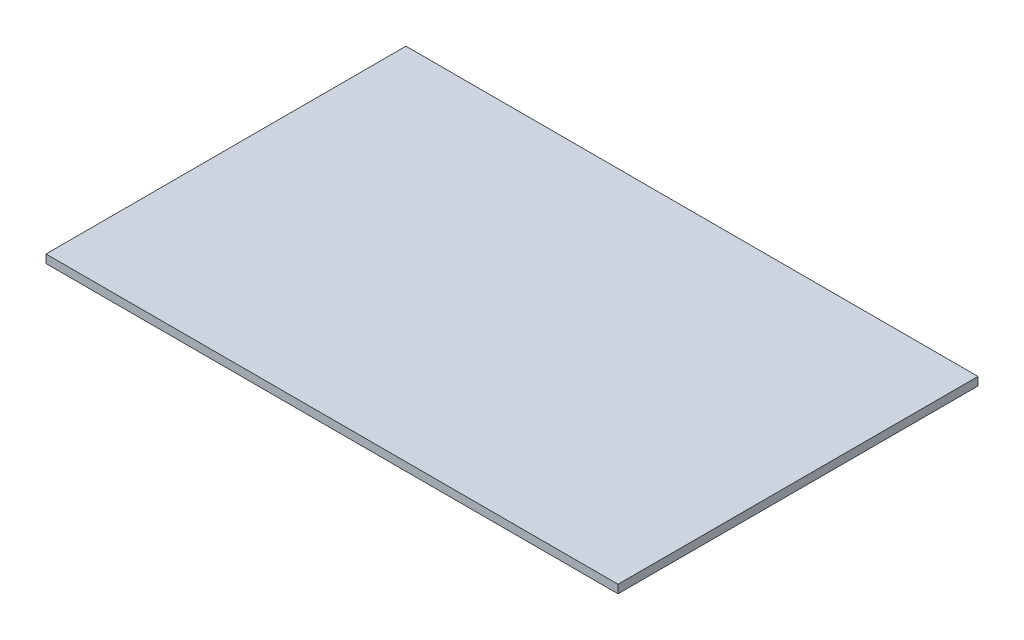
from build123d import *

# Parameters (mm, degrees)
SKETCH3_W           = 413.2
SKETCH3_H           = 260
BOSS_EXTRUDE2_DEPTH = 6


with BuildPart() as part:
    # Sketch3 → Boss-Extrude2 (new body)
    with BuildSketch(Plane(origin=(0, 0, 0), x_dir=(1, 0, 0), z_dir=(0, 1, 0))):
        Rectangle(SKETCH3_W, SKETCH3_H)
    extrude(amount=BOSS_EXTRUDE2_DEPTH)


solid = part.part
